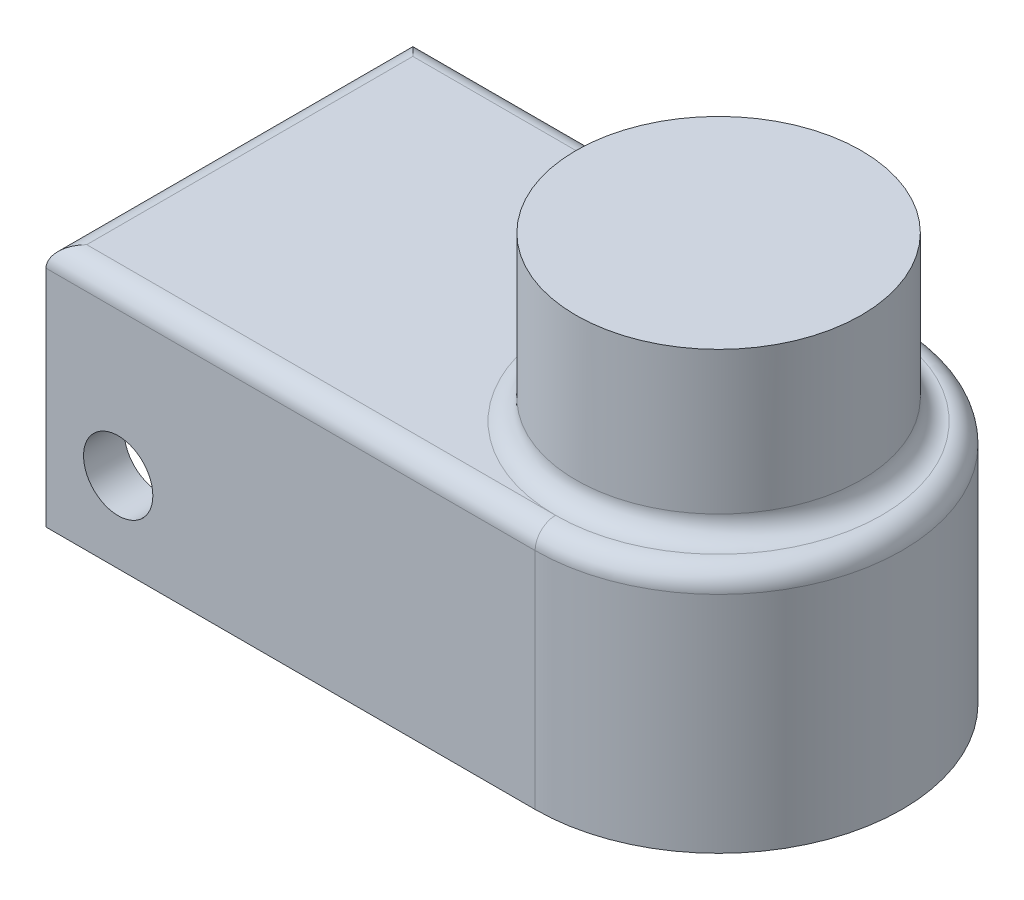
ISO-10303-21;
HEADER;
FILE_DESCRIPTION(('STEP AP214'),'2;1');
FILE_NAME('part.step','',(''),(''),'','','');
FILE_SCHEMA(('AUTOMOTIVE_DESIGN { 1 0 10303 214 1 1 1 1 }'));
ENDSEC;
DATA;
#1=APPLICATION_CONTEXT('core data for automotive mechanical design processes');
#2=APPLICATION_PROTOCOL_DEFINITION('international standard','automotive_design',2000,#1);
#3=PRODUCT_CONTEXT('',#1,'mechanical');
#4=PRODUCT('Part','Part','',(#3));
#5=PRODUCT_RELATED_PRODUCT_CATEGORY('part','',(#4));
#6=PRODUCT_DEFINITION_FORMATION('','',#4);
#7=PRODUCT_DEFINITION_CONTEXT('part definition',#1,'design');
#8=PRODUCT_DEFINITION('design','',#6,#7);
#9=PRODUCT_DEFINITION_SHAPE('','',#8);
#10=(LENGTH_UNIT() NAMED_UNIT(*) SI_UNIT(.MILLI.,.METRE.));
#11=(NAMED_UNIT(*) PLANE_ANGLE_UNIT() SI_UNIT($,.RADIAN.));
#12=(NAMED_UNIT(*) SI_UNIT($,.STERADIAN.) SOLID_ANGLE_UNIT());
#13=UNCERTAINTY_MEASURE_WITH_UNIT(LENGTH_MEASURE(1.E-05),#10,'distance_accuracy_value','');
#14=(GEOMETRIC_REPRESENTATION_CONTEXT(3) GLOBAL_UNCERTAINTY_ASSIGNED_CONTEXT((#13)) GLOBAL_UNIT_ASSIGNED_CONTEXT((#10,
#11,#12)) REPRESENTATION_CONTEXT('',''));
#15=CARTESIAN_POINT('',(0.,0.,0.));
#16=DIRECTION('',(0.,0.,1.));
#17=DIRECTION('',(1.,0.,0.));
#18=AXIS2_PLACEMENT_3D('',#15,#16,#17);
#19=CARTESIAN_POINT('',(152.4,76.2,-57.15));
#20=DIRECTION('',(0.,-1.,0.));
#21=DIRECTION('',(0.,0.,-1.));
#22=AXIS2_PLACEMENT_3D('',#19,#20,#21);
#23=PLANE('',#22);
#24=CARTESIAN_POINT('',(152.4,76.2,-57.15));
#25=DIRECTION('',(0.,-1.,0.));
#26=DIRECTION('',(0.,0.,-1.));
#27=AXIS2_PLACEMENT_3D('',#24,#25,#26);
#28=CIRCLE('',#27,50.8);
#29=CARTESIAN_POINT('',(152.4,76.2,-6.35));
#30=VERTEX_POINT('',#29);
#31=CARTESIAN_POINT('',(152.4,76.2,-107.95));
#32=VERTEX_POINT('',#31);
#33=EDGE_CURVE('E180',#30,#32,#28,.T.);
#34=ORIENTED_EDGE('',*,*,#33,.T.);
#35=DIRECTION('',(-1.,0.,0.));
#36=VECTOR('',#35,1.);
#37=CARTESIAN_POINT('',(152.4,76.2,-107.95));
#38=LINE('',#37,#36);
#39=CARTESIAN_POINT('',(6.34999999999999,76.2,-107.95));
#40=VERTEX_POINT('',#39);
#41=EDGE_CURVE('E182',#32,#40,#38,.T.);
#42=ORIENTED_EDGE('',*,*,#41,.T.);
#43=DIRECTION('',(0.,0.,1.));
#44=VECTOR('',#43,1.);
#45=CARTESIAN_POINT('',(6.34999999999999,76.2,-57.15));
#46=LINE('',#45,#44);
#47=CARTESIAN_POINT('',(6.34999999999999,76.2,-6.35));
#48=VERTEX_POINT('',#47);
#49=EDGE_CURVE('E178',#40,#48,#46,.T.);
#50=ORIENTED_EDGE('',*,*,#49,.T.);
#51=DIRECTION('',(1.,0.,0.));
#52=VECTOR('',#51,1.);
#53=CARTESIAN_POINT('',(152.4,76.2,-6.35));
#54=LINE('',#53,#52);
#55=EDGE_CURVE('E172',#48,#30,#54,.T.);
#56=ORIENTED_EDGE('',*,*,#55,.T.);
#57=EDGE_LOOP('',(#34,#42,#50,#56));
#58=FACE_BOUND('',#57,.T.);
#59=ADVANCED_FACE('F31',(#58),#23,.F.);
#60=CARTESIAN_POINT('',(0.,76.2,0.));
#61=DIRECTION('',(1.,0.,0.));
#62=DIRECTION('',(0.,0.,-1.));
#63=AXIS2_PLACEMENT_3D('',#60,#61,#62);
#64=PLANE('',#63);
#65=DIRECTION('',(0.,-1.,0.));
#66=VECTOR('',#65,1.);
#67=CARTESIAN_POINT('',(0.,76.2,0.));
#68=LINE('',#67,#66);
#69=CARTESIAN_POINT('',(0.,69.85,0.));
#70=VERTEX_POINT('',#69);
#71=CARTESIAN_POINT('',(0.,0.,0.));
#72=VERTEX_POINT('',#71);
#73=EDGE_CURVE('E170',#70,#72,#68,.T.);
#74=ORIENTED_EDGE('',*,*,#73,.F.);
#75=DIRECTION('',(0.,0.,1.));
#76=VECTOR('',#75,1.);
#77=CARTESIAN_POINT('',(0.,69.85,0.));
#78=LINE('',#77,#76);
#79=CARTESIAN_POINT('',(0.,69.85,-114.3));
#80=VERTEX_POINT('',#79);
#81=EDGE_CURVE('E40',#70,#80,#78,.F.);
#82=ORIENTED_EDGE('',*,*,#81,.T.);
#83=DIRECTION('',(0.,-1.,0.));
#84=VECTOR('',#83,1.);
#85=CARTESIAN_POINT('',(0.,76.2,-114.3));
#86=LINE('',#85,#84);
#87=CARTESIAN_POINT('',(0.,0.,-114.3));
#88=VERTEX_POINT('',#87);
#89=EDGE_CURVE('E164',#80,#88,#86,.T.);
#90=ORIENTED_EDGE('',*,*,#89,.T.);
#91=DIRECTION('',(0.,0.,1.));
#92=VECTOR('',#91,1.);
#93=CARTESIAN_POINT('',(0.,0.,0.));
#94=LINE('',#93,#92);
#95=CARTESIAN_POINT('',(0.,0.,-101.6));
#96=VERTEX_POINT('',#95);
#97=EDGE_CURVE('E153',#88,#96,#94,.T.);
#98=ORIENTED_EDGE('',*,*,#97,.T.);
#99=DIRECTION('',(0.,-1.,0.));
#100=VECTOR('',#99,1.);
#101=CARTESIAN_POINT('',(0.,37.592,-101.6));
#102=LINE('',#101,#100);
#103=CARTESIAN_POINT('',(0.,37.592,-101.6));
#104=VERTEX_POINT('',#103);
#105=EDGE_CURVE('E120',#104,#96,#102,.T.);
#106=ORIENTED_EDGE('',*,*,#105,.F.);
#107=DIRECTION('',(0.,0.,-1.));
#108=VECTOR('',#107,1.);
#109=CARTESIAN_POINT('',(0.,37.592,-12.7));
#110=LINE('',#109,#108);
#111=CARTESIAN_POINT('',(0.,37.592,-12.7));
#112=VERTEX_POINT('',#111);
#113=EDGE_CURVE('E127',#112,#104,#110,.T.);
#114=ORIENTED_EDGE('',*,*,#113,.F.);
#115=DIRECTION('',(0.,-1.,0.));
#116=VECTOR('',#115,1.);
#117=CARTESIAN_POINT('',(0.,37.592,-12.7));
#118=LINE('',#117,#116);
#119=CARTESIAN_POINT('',(0.,0.,-12.7));
#120=VERTEX_POINT('',#119);
#121=EDGE_CURVE('E109',#112,#120,#118,.T.);
#122=ORIENTED_EDGE('',*,*,#121,.T.);
#123=EDGE_CURVE('E149',#120,#72,#94,.T.);
#124=ORIENTED_EDGE('',*,*,#123,.T.);
#125=EDGE_LOOP('',(#74,#82,#90,#98,#106,#114,#122,#124));
#126=FACE_BOUND('',#125,.T.);
#127=ADVANCED_FACE('F132',(#126),#64,.F.);
#128=CARTESIAN_POINT('',(0.,76.2,0.));
#129=DIRECTION('',(0.,0.,-1.));
#130=DIRECTION('',(-1.,0.,0.));
#131=AXIS2_PLACEMENT_3D('',#128,#129,#130);
#132=PLANE('',#131);
#133=CARTESIAN_POINT('',(22.4900013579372,25.1025379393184,0.));
#134=DIRECTION('',(0.,0.,1.));
#135=DIRECTION('',(1.,0.,0.));
#136=AXIS2_PLACEMENT_3D('',#133,#134,#135);
#137=CIRCLE('',#136,10.7961289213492);
#138=CARTESIAN_POINT('',(33.2861302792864,25.1025379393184,0.));
#139=VERTEX_POINT('',#138);
#140=EDGE_CURVE('E208',#139,#139,#137,.T.);
#141=ORIENTED_EDGE('',*,*,#140,.F.);
#142=EDGE_LOOP('',(#141));
#143=FACE_BOUND('',#142,.T.);
#144=DIRECTION('',(0.,-1.,0.));
#145=VECTOR('',#144,1.);
#146=CARTESIAN_POINT('',(152.4,76.2,0.));
#147=LINE('',#146,#145);
#148=CARTESIAN_POINT('',(152.4,69.85,0.));
#149=VERTEX_POINT('',#148);
#150=CARTESIAN_POINT('',(152.4,0.,0.));
#151=VERTEX_POINT('',#150);
#152=EDGE_CURVE('E168',#149,#151,#147,.T.);
#153=ORIENTED_EDGE('',*,*,#152,.F.);
#154=DIRECTION('',(1.,0.,0.));
#155=VECTOR('',#154,1.);
#156=CARTESIAN_POINT('',(0.,69.85,0.));
#157=LINE('',#156,#155);
#158=EDGE_CURVE('E11',#149,#70,#157,.F.);
#159=ORIENTED_EDGE('',*,*,#158,.T.);
#160=ORIENTED_EDGE('',*,*,#73,.T.);
#161=DIRECTION('',(1.,0.,0.));
#162=VECTOR('',#161,1.);
#163=CARTESIAN_POINT('',(0.,0.,0.));
#164=LINE('',#163,#162);
#165=EDGE_CURVE('E155',#72,#151,#164,.T.);
#166=ORIENTED_EDGE('',*,*,#165,.T.);
#167=EDGE_LOOP('',(#153,#159,#160,#166));
#168=FACE_BOUND('',#167,.T.);
#169=ADVANCED_FACE('F241',(#143,#168),#132,.F.);
#170=CARTESIAN_POINT('',(152.4,76.2,-57.15));
#171=DIRECTION('',(0.,-1.,0.));
#172=DIRECTION('',(0.,0.,-1.));
#173=AXIS2_PLACEMENT_3D('',#170,#171,#172);
#174=CYLINDRICAL_SURFACE('',#173,57.15);
#175=DIRECTION('',(0.,-1.,0.));
#176=VECTOR('',#175,1.);
#177=CARTESIAN_POINT('',(152.4,76.2,-114.3));
#178=LINE('',#177,#176);
#179=CARTESIAN_POINT('',(152.4,69.85,-114.3));
#180=VERTEX_POINT('',#179);
#181=CARTESIAN_POINT('',(152.4,0.,-114.3));
#182=VERTEX_POINT('',#181);
#183=EDGE_CURVE('E166',#180,#182,#178,.T.);
#184=ORIENTED_EDGE('',*,*,#183,.F.);
#185=CARTESIAN_POINT('',(152.4,69.85,-57.15));
#186=DIRECTION('',(0.,-1.,0.));
#187=DIRECTION('',(0.,0.,-1.));
#188=AXIS2_PLACEMENT_3D('',#185,#186,#187);
#189=CIRCLE('',#188,57.15);
#190=EDGE_CURVE('E54',#180,#149,#189,.T.);
#191=ORIENTED_EDGE('',*,*,#190,.T.);
#192=ORIENTED_EDGE('',*,*,#152,.T.);
#193=CARTESIAN_POINT('',(152.4,0.,-57.15));
#194=DIRECTION('',(0.,1.,0.));
#195=DIRECTION('',(0.,0.,-1.));
#196=AXIS2_PLACEMENT_3D('',#193,#194,#195);
#197=CIRCLE('',#196,57.15);
#198=EDGE_CURVE('E158',#151,#182,#197,.T.);
#199=ORIENTED_EDGE('',*,*,#198,.T.);
#200=EDGE_LOOP('',(#184,#191,#192,#199));
#201=FACE_BOUND('',#200,.T.);
#202=ADVANCED_FACE('F253',(#201),#174,.T.);
#203=CARTESIAN_POINT('',(0.,76.2,-114.3));
#204=DIRECTION('',(0.,0.,1.));
#205=DIRECTION('',(1.,0.,0.));
#206=AXIS2_PLACEMENT_3D('',#203,#204,#205);
#207=PLANE('',#206);
#208=CARTESIAN_POINT('',(22.4900013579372,25.1025379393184,-114.3));
#209=DIRECTION('',(0.,0.,1.));
#210=DIRECTION('',(1.,0.,0.));
#211=AXIS2_PLACEMENT_3D('',#208,#209,#210);
#212=CIRCLE('',#211,10.7961289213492);
#213=CARTESIAN_POINT('',(33.2861302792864,25.1025379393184,-114.3));
#214=VERTEX_POINT('',#213);
#215=EDGE_CURVE('E176',#214,#214,#212,.T.);
#216=ORIENTED_EDGE('',*,*,#215,.T.);
#217=EDGE_LOOP('',(#216));
#218=FACE_BOUND('',#217,.T.);
#219=ORIENTED_EDGE('',*,*,#89,.F.);
#220=DIRECTION('',(-1.,0.,0.));
#221=VECTOR('',#220,1.);
#222=CARTESIAN_POINT('',(0.,69.85,-114.3));
#223=LINE('',#222,#221);
#224=EDGE_CURVE('E185',#80,#180,#223,.F.);
#225=ORIENTED_EDGE('',*,*,#224,.T.);
#226=ORIENTED_EDGE('',*,*,#183,.T.);
#227=DIRECTION('',(-1.,0.,0.));
#228=VECTOR('',#227,1.);
#229=CARTESIAN_POINT('',(0.,0.,-114.3));
#230=LINE('',#229,#228);
#231=EDGE_CURVE('E161',#182,#88,#230,.T.);
#232=ORIENTED_EDGE('',*,*,#231,.T.);
#233=EDGE_LOOP('',(#219,#225,#226,#232));
#234=FACE_BOUND('',#233,.T.);
#235=ADVANCED_FACE('F249',(#218,#234),#207,.F.);
#236=CARTESIAN_POINT('',(152.4,0.,-57.15));
#237=DIRECTION('',(0.,-1.,0.));
#238=DIRECTION('',(0.,0.,-1.));
#239=AXIS2_PLACEMENT_3D('',#236,#237,#238);
#240=PLANE('',#239);
#241=DIRECTION('',(-1.,0.,0.));
#242=VECTOR('',#241,1.);
#243=CARTESIAN_POINT('',(152.4,0.,-12.7));
#244=LINE('',#243,#242);
#245=CARTESIAN_POINT('',(152.4,0.,-12.7));
#246=VERTEX_POINT('',#245);
#247=EDGE_CURVE('E115',#246,#120,#244,.T.);
#248=ORIENTED_EDGE('',*,*,#247,.F.);
#249=CARTESIAN_POINT('',(152.4,0.,-57.15));
#250=DIRECTION('',(0.,-1.,0.));
#251=DIRECTION('',(0.,0.,-1.));
#252=AXIS2_PLACEMENT_3D('',#249,#250,#251);
#253=CIRCLE('',#252,44.45);
#254=CARTESIAN_POINT('',(152.4,0.,-101.6));
#255=VERTEX_POINT('',#254);
#256=EDGE_CURVE('E130',#255,#246,#253,.T.);
#257=ORIENTED_EDGE('',*,*,#256,.F.);
#258=DIRECTION('',(1.,0.,0.));
#259=VECTOR('',#258,1.);
#260=CARTESIAN_POINT('',(0.,0.,-101.6));
#261=LINE('',#260,#259);
#262=EDGE_CURVE('E141',#96,#255,#261,.T.);
#263=ORIENTED_EDGE('',*,*,#262,.F.);
#264=ORIENTED_EDGE('',*,*,#97,.F.);
#265=ORIENTED_EDGE('',*,*,#231,.F.);
#266=ORIENTED_EDGE('',*,*,#198,.F.);
#267=ORIENTED_EDGE('',*,*,#165,.F.);
#268=ORIENTED_EDGE('',*,*,#123,.F.);
#269=EDGE_LOOP('',(#248,#257,#263,#264,#265,#266,#267,#268));
#270=FACE_BOUND('',#269,.T.);
#271=ADVANCED_FACE('F246',(#270),#240,.T.);
#272=CARTESIAN_POINT('',(152.4,37.592,-12.7));
#273=DIRECTION('',(0.,0.,1.));
#274=DIRECTION('',(1.,0.,0.));
#275=AXIS2_PLACEMENT_3D('',#272,#273,#274);
#276=PLANE('',#275);
#277=CARTESIAN_POINT('',(22.4900013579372,25.1025379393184,-12.7));
#278=DIRECTION('',(0.,0.,1.));
#279=DIRECTION('',(1.,0.,0.));
#280=AXIS2_PLACEMENT_3D('',#277,#278,#279);
#281=CIRCLE('',#280,10.7961289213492);
#282=CARTESIAN_POINT('',(33.2861302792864,25.1025379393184,-12.7));
#283=VERTEX_POINT('',#282);
#284=EDGE_CURVE('E142',#283,#283,#281,.T.);
#285=ORIENTED_EDGE('',*,*,#284,.T.);
#286=EDGE_LOOP('',(#285));
#287=FACE_BOUND('',#286,.T.);
#288=ORIENTED_EDGE('',*,*,#247,.T.);
#289=ORIENTED_EDGE('',*,*,#121,.F.);
#290=DIRECTION('',(-1.,0.,0.));
#291=VECTOR('',#290,1.);
#292=CARTESIAN_POINT('',(152.4,37.592,-12.7));
#293=LINE('',#292,#291);
#294=CARTESIAN_POINT('',(152.4,37.592,-12.7));
#295=VERTEX_POINT('',#294);
#296=EDGE_CURVE('E112',#295,#112,#293,.T.);
#297=ORIENTED_EDGE('',*,*,#296,.F.);
#298=DIRECTION('',(0.,-1.,0.));
#299=VECTOR('',#298,1.);
#300=CARTESIAN_POINT('',(152.4,37.592,-12.7));
#301=LINE('',#300,#299);
#302=EDGE_CURVE('E147',#295,#246,#301,.T.);
#303=ORIENTED_EDGE('',*,*,#302,.T.);
#304=EDGE_LOOP('',(#288,#289,#297,#303));
#305=FACE_BOUND('',#304,.T.);
#306=ADVANCED_FACE('F111',(#287,#305),#276,.F.);
#307=CARTESIAN_POINT('',(152.4,37.592,-57.15));
#308=DIRECTION('',(0.,-1.,0.));
#309=DIRECTION('',(0.,0.,-1.));
#310=AXIS2_PLACEMENT_3D('',#307,#308,#309);
#311=CYLINDRICAL_SURFACE('',#310,44.45);
#312=ORIENTED_EDGE('',*,*,#256,.T.);
#313=ORIENTED_EDGE('',*,*,#302,.F.);
#314=CARTESIAN_POINT('',(152.4,37.592,-57.15));
#315=DIRECTION('',(0.,-1.,0.));
#316=DIRECTION('',(0.,0.,-1.));
#317=AXIS2_PLACEMENT_3D('',#314,#315,#316);
#318=CIRCLE('',#317,44.45);
#319=CARTESIAN_POINT('',(152.4,37.592,-101.6));
#320=VERTEX_POINT('',#319);
#321=EDGE_CURVE('E121',#320,#295,#318,.T.);
#322=ORIENTED_EDGE('',*,*,#321,.F.);
#323=DIRECTION('',(0.,-1.,0.));
#324=VECTOR('',#323,1.);
#325=CARTESIAN_POINT('',(152.4,37.592,-101.6));
#326=LINE('',#325,#324);
#327=EDGE_CURVE('E150',#320,#255,#326,.T.);
#328=ORIENTED_EDGE('',*,*,#327,.T.);
#329=EDGE_LOOP('',(#312,#313,#322,#328));
#330=FACE_BOUND('',#329,.T.);
#331=ADVANCED_FACE('F296',(#330),#311,.F.);
#332=CARTESIAN_POINT('',(0.,37.592,-101.6));
#333=DIRECTION('',(0.,0.,-1.));
#334=DIRECTION('',(-1.,0.,0.));
#335=AXIS2_PLACEMENT_3D('',#332,#333,#334);
#336=PLANE('',#335);
#337=CARTESIAN_POINT('',(22.4900013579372,25.1025379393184,-101.6));
#338=DIRECTION('',(0.,0.,-1.));
#339=DIRECTION('',(-1.,0.,0.));
#340=AXIS2_PLACEMENT_3D('',#337,#338,#339);
#341=CIRCLE('',#340,10.7961289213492);
#342=CARTESIAN_POINT('',(33.2861302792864,25.1025379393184,-101.6));
#343=VERTEX_POINT('',#342);
#344=EDGE_CURVE('E173',#343,#343,#341,.T.);
#345=ORIENTED_EDGE('',*,*,#344,.T.);
#346=EDGE_LOOP('',(#345));
#347=FACE_BOUND('',#346,.T.);
#348=ORIENTED_EDGE('',*,*,#262,.T.);
#349=ORIENTED_EDGE('',*,*,#327,.F.);
#350=DIRECTION('',(1.,0.,0.));
#351=VECTOR('',#350,1.);
#352=CARTESIAN_POINT('',(0.,37.592,-101.6));
#353=LINE('',#352,#351);
#354=EDGE_CURVE('E134',#104,#320,#353,.T.);
#355=ORIENTED_EDGE('',*,*,#354,.F.);
#356=ORIENTED_EDGE('',*,*,#105,.T.);
#357=EDGE_LOOP('',(#348,#349,#355,#356));
#358=FACE_BOUND('',#357,.T.);
#359=ADVANCED_FACE('F294',(#347,#358),#336,.F.);
#360=CARTESIAN_POINT('',(152.4,37.592,-57.15));
#361=DIRECTION('',(0.,-1.,0.));
#362=DIRECTION('',(0.,0.,-1.));
#363=AXIS2_PLACEMENT_3D('',#360,#361,#362);
#364=PLANE('',#363);
#365=ORIENTED_EDGE('',*,*,#296,.T.);
#366=ORIENTED_EDGE('',*,*,#113,.T.);
#367=ORIENTED_EDGE('',*,*,#354,.T.);
#368=ORIENTED_EDGE('',*,*,#321,.T.);
#369=EDGE_LOOP('',(#365,#366,#367,#368));
#370=FACE_BOUND('',#369,.T.);
#371=ADVANCED_FACE('F125',(#370),#364,.T.);
#372=CARTESIAN_POINT('',(22.4900013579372,25.1025379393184,-114.3));
#373=DIRECTION('',(0.,0.,1.));
#374=DIRECTION('',(1.,0.,0.));
#375=AXIS2_PLACEMENT_3D('',#372,#373,#374);
#376=CYLINDRICAL_SURFACE('',#375,10.7961289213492);
#377=CARTESIAN_POINT('',(33.2861302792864,25.1025379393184,-114.3));
#378=CARTESIAN_POINT('',(33.2861302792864,25.1025379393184,-114.167708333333));
#379=CARTESIAN_POINT('',(33.2861302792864,25.1025379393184,-114.035416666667));
#380=CARTESIAN_POINT('',(33.2861302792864,25.1025379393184,-113.770833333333));
#381=CARTESIAN_POINT('',(33.2861302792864,25.1025379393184,-113.638541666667));
#382=CARTESIAN_POINT('',(33.2861302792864,25.1025379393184,-113.373958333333));
#383=CARTESIAN_POINT('',(33.2861302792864,25.1025379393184,-113.241666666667));
#384=CARTESIAN_POINT('',(33.2861302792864,25.1025379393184,-112.977083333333));
#385=CARTESIAN_POINT('',(33.2861302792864,25.1025379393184,-112.844791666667));
#386=CARTESIAN_POINT('',(33.2861302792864,25.1025379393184,-112.580208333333));
#387=CARTESIAN_POINT('',(33.2861302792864,25.1025379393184,-112.447916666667));
#388=CARTESIAN_POINT('',(33.2861302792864,25.1025379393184,-112.183333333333));
#389=CARTESIAN_POINT('',(33.2861302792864,25.1025379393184,-112.051041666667));
#390=CARTESIAN_POINT('',(33.2861302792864,25.1025379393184,-111.786458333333));
#391=CARTESIAN_POINT('',(33.2861302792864,25.1025379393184,-111.654166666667));
#392=CARTESIAN_POINT('',(33.2861302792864,25.1025379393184,-111.389583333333));
#393=CARTESIAN_POINT('',(33.2861302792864,25.1025379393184,-111.257291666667));
#394=CARTESIAN_POINT('',(33.2861302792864,25.1025379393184,-110.992708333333));
#395=CARTESIAN_POINT('',(33.2861302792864,25.1025379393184,-110.860416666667));
#396=CARTESIAN_POINT('',(33.2861302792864,25.1025379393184,-110.595833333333));
#397=CARTESIAN_POINT('',(33.2861302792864,25.1025379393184,-110.463541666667));
#398=CARTESIAN_POINT('',(33.2861302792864,25.1025379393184,-110.198958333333));
#399=CARTESIAN_POINT('',(33.2861302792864,25.1025379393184,-110.066666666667));
#400=CARTESIAN_POINT('',(33.2861302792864,25.1025379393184,-109.802083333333));
#401=CARTESIAN_POINT('',(33.2861302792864,25.1025379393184,-109.669791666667));
#402=CARTESIAN_POINT('',(33.2861302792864,25.1025379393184,-109.405208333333));
#403=CARTESIAN_POINT('',(33.2861302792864,25.1025379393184,-109.272916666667));
#404=CARTESIAN_POINT('',(33.2861302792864,25.1025379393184,-109.008333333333));
#405=CARTESIAN_POINT('',(33.2861302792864,25.1025379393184,-108.876041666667));
#406=CARTESIAN_POINT('',(33.2861302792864,25.1025379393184,-108.611458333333));
#407=CARTESIAN_POINT('',(33.2861302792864,25.1025379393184,-108.479166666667));
#408=CARTESIAN_POINT('',(33.2861302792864,25.1025379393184,-108.214583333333));
#409=CARTESIAN_POINT('',(33.2861302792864,25.1025379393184,-108.082291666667));
#410=CARTESIAN_POINT('',(33.2861302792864,25.1025379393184,-107.817708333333));
#411=CARTESIAN_POINT('',(33.2861302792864,25.1025379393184,-107.685416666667));
#412=CARTESIAN_POINT('',(33.2861302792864,25.1025379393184,-107.420833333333));
#413=CARTESIAN_POINT('',(33.2861302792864,25.1025379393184,-107.288541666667));
#414=CARTESIAN_POINT('',(33.2861302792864,25.1025379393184,-107.023958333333));
#415=CARTESIAN_POINT('',(33.2861302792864,25.1025379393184,-106.891666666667));
#416=CARTESIAN_POINT('',(33.2861302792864,25.1025379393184,-106.627083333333));
#417=CARTESIAN_POINT('',(33.2861302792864,25.1025379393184,-106.494791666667));
#418=CARTESIAN_POINT('',(33.2861302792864,25.1025379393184,-106.230208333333));
#419=CARTESIAN_POINT('',(33.2861302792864,25.1025379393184,-106.097916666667));
#420=CARTESIAN_POINT('',(33.2861302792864,25.1025379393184,-105.833333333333));
#421=CARTESIAN_POINT('',(33.2861302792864,25.1025379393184,-105.701041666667));
#422=CARTESIAN_POINT('',(33.2861302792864,25.1025379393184,-105.436458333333));
#423=CARTESIAN_POINT('',(33.2861302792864,25.1025379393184,-105.304166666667));
#424=CARTESIAN_POINT('',(33.2861302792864,25.1025379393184,-105.039583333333));
#425=CARTESIAN_POINT('',(33.2861302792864,25.1025379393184,-104.907291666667));
#426=CARTESIAN_POINT('',(33.2861302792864,25.1025379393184,-104.642708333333));
#427=CARTESIAN_POINT('',(33.2861302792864,25.1025379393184,-104.510416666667));
#428=CARTESIAN_POINT('',(33.2861302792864,25.1025379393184,-104.245833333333));
#429=CARTESIAN_POINT('',(33.2861302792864,25.1025379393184,-104.113541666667));
#430=CARTESIAN_POINT('',(33.2861302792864,25.1025379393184,-103.848958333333));
#431=CARTESIAN_POINT('',(33.2861302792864,25.1025379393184,-103.716666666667));
#432=CARTESIAN_POINT('',(33.2861302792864,25.1025379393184,-103.452083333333));
#433=CARTESIAN_POINT('',(33.2861302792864,25.1025379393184,-103.319791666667));
#434=CARTESIAN_POINT('',(33.2861302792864,25.1025379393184,-103.055208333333));
#435=CARTESIAN_POINT('',(33.2861302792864,25.1025379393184,-102.922916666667));
#436=CARTESIAN_POINT('',(33.2861302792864,25.1025379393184,-102.658333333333));
#437=CARTESIAN_POINT('',(33.2861302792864,25.1025379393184,-102.526041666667));
#438=CARTESIAN_POINT('',(33.2861302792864,25.1025379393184,-102.261458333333));
#439=CARTESIAN_POINT('',(33.2861302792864,25.1025379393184,-102.129166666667));
#440=CARTESIAN_POINT('',(33.2861302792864,25.1025379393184,-101.864583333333));
#441=CARTESIAN_POINT('',(33.2861302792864,25.1025379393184,-101.732291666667));
#442=CARTESIAN_POINT('',(33.2861302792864,25.1025379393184,-101.6));
#443=B_SPLINE_CURVE_WITH_KNOTS('',3,(#377,#378,#379,#380,#381,#382,#383,#384,#385,#386,#387,
#388,#389,#390,#391,#392,#393,#394,#395,#396,#397,#398,#399,#400,#401,#402,#403,#404,#405,#406,
#407,#408,#409,#410,#411,#412,#413,#414,#415,#416,#417,#418,#419,#420,#421,#422,#423,#424,#425,
#426,#427,#428,#429,#430,#431,#432,#433,#434,#435,#436,#437,#438,#439,#440,#441,#442),
.UNSPECIFIED.,.F.,.F.,(4,2,2,2,2,2,2,2,2,2,2,2,2,2,2,2,2,2,2,2,2,2,2,2,2,2,2,2,2,2,2,2,4),(0.,
0.396875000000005,0.79375000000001,1.19062500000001,1.58750000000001,1.98437500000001,
2.38125000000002,2.77812500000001,3.17500000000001,3.57187500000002,3.96875000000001,
4.36562500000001,4.76250000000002,5.15937500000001,5.55625000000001,5.95312500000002,
6.35000000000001,6.74687500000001,7.14375000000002,7.54062500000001,7.93750000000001,
8.33437500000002,8.73125000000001,9.12812500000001,9.52500000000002,9.92187500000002,10.31875,
10.715625,11.1125,11.509375,11.90625,12.303125,12.7),.UNSPECIFIED.);
#444=EDGE_CURVE('BSEAM223',#214,#343,#443,.T.);
#445=ORIENTED_EDGE('',*,*,#215,.F.);
#446=ORIENTED_EDGE('',*,*,#344,.F.);
#447=ORIENTED_EDGE('',*,*,#444,.T.);
#448=ORIENTED_EDGE('',*,*,#444,.F.);
#449=EDGE_LOOP('',(#445,#447,#446,#448));
#450=FACE_BOUND('',#449,.T.);
#451=ADVANCED_FACE('F223',(#450),#376,.F.);
#452=CARTESIAN_POINT('',(33.2861302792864,25.1025379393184,0.));
#453=CARTESIAN_POINT('',(33.2861302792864,25.1025379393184,-0.132291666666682));
#454=CARTESIAN_POINT('',(33.2861302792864,25.1025379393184,-0.26458333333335));
#455=CARTESIAN_POINT('',(33.2861302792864,25.1025379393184,-0.529166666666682));
#456=CARTESIAN_POINT('',(33.2861302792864,25.1025379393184,-0.661458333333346));
#457=CARTESIAN_POINT('',(33.2861302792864,25.1025379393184,-0.926041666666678));
#458=CARTESIAN_POINT('',(33.2861302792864,25.1025379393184,-1.05833333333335));
#459=CARTESIAN_POINT('',(33.2861302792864,25.1025379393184,-1.32291666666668));
#460=CARTESIAN_POINT('',(33.2861302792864,25.1025379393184,-1.45520833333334));
#461=CARTESIAN_POINT('',(33.2861302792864,25.1025379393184,-1.71979166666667));
#462=CARTESIAN_POINT('',(33.2861302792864,25.1025379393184,-1.85208333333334));
#463=CARTESIAN_POINT('',(33.2861302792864,25.1025379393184,-2.11666666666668));
#464=CARTESIAN_POINT('',(33.2861302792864,25.1025379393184,-2.24895833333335));
#465=CARTESIAN_POINT('',(33.2861302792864,25.1025379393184,-2.51354166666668));
#466=CARTESIAN_POINT('',(33.2861302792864,25.1025379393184,-2.64583333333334));
#467=CARTESIAN_POINT('',(33.2861302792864,25.1025379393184,-2.91041666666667));
#468=CARTESIAN_POINT('',(33.2861302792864,25.1025379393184,-3.04270833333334));
#469=CARTESIAN_POINT('',(33.2861302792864,25.1025379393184,-3.30729166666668));
#470=CARTESIAN_POINT('',(33.2861302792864,25.1025379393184,-3.43958333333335));
#471=CARTESIAN_POINT('',(33.2861302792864,25.1025379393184,-3.70416666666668));
#472=CARTESIAN_POINT('',(33.2861302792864,25.1025379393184,-3.83645833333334));
#473=CARTESIAN_POINT('',(33.2861302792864,25.1025379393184,-4.10104166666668));
#474=CARTESIAN_POINT('',(33.2861302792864,25.1025379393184,-4.23333333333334));
#475=CARTESIAN_POINT('',(33.2861302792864,25.1025379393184,-4.49791666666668));
#476=CARTESIAN_POINT('',(33.2861302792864,25.1025379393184,-4.63020833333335));
#477=CARTESIAN_POINT('',(33.2861302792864,25.1025379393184,-4.89479166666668));
#478=CARTESIAN_POINT('',(33.2861302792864,25.1025379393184,-5.02708333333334));
#479=CARTESIAN_POINT('',(33.2861302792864,25.1025379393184,-5.29166666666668));
#480=CARTESIAN_POINT('',(33.2861302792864,25.1025379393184,-5.42395833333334));
#481=CARTESIAN_POINT('',(33.2861302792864,25.1025379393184,-5.68854166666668));
#482=CARTESIAN_POINT('',(33.2861302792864,25.1025379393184,-5.82083333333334));
#483=CARTESIAN_POINT('',(33.2861302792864,25.1025379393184,-6.08541666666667));
#484=CARTESIAN_POINT('',(33.2861302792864,25.1025379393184,-6.21770833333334));
#485=CARTESIAN_POINT('',(33.2861302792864,25.1025379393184,-6.48229166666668));
#486=CARTESIAN_POINT('',(33.2861302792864,25.1025379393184,-6.61458333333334));
#487=CARTESIAN_POINT('',(33.2861302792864,25.1025379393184,-6.87916666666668));
#488=CARTESIAN_POINT('',(33.2861302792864,25.1025379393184,-7.01145833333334));
#489=CARTESIAN_POINT('',(33.2861302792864,25.1025379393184,-7.27604166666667));
#490=CARTESIAN_POINT('',(33.2861302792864,25.1025379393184,-7.40833333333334));
#491=CARTESIAN_POINT('',(33.2861302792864,25.1025379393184,-7.67291666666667));
#492=CARTESIAN_POINT('',(33.2861302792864,25.1025379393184,-7.80520833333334));
#493=CARTESIAN_POINT('',(33.2861302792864,25.1025379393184,-8.06979166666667));
#494=CARTESIAN_POINT('',(33.2861302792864,25.1025379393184,-8.20208333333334));
#495=CARTESIAN_POINT('',(33.2861302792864,25.1025379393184,-8.46666666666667));
#496=CARTESIAN_POINT('',(33.2861302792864,25.1025379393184,-8.59895833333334));
#497=CARTESIAN_POINT('',(33.2861302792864,25.1025379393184,-8.86354166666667));
#498=CARTESIAN_POINT('',(33.2861302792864,25.1025379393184,-8.99583333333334));
#499=CARTESIAN_POINT('',(33.2861302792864,25.1025379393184,-9.26041666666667));
#500=CARTESIAN_POINT('',(33.2861302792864,25.1025379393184,-9.39270833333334));
#501=CARTESIAN_POINT('',(33.2861302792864,25.1025379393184,-9.65729166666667));
#502=CARTESIAN_POINT('',(33.2861302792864,25.1025379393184,-9.78958333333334));
#503=CARTESIAN_POINT('',(33.2861302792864,25.1025379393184,-10.0541666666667));
#504=CARTESIAN_POINT('',(33.2861302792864,25.1025379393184,-10.1864583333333));
#505=CARTESIAN_POINT('',(33.2861302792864,25.1025379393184,-10.4510416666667));
#506=CARTESIAN_POINT('',(33.2861302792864,25.1025379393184,-10.5833333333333));
#507=CARTESIAN_POINT('',(33.2861302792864,25.1025379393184,-10.8479166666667));
#508=CARTESIAN_POINT('',(33.2861302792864,25.1025379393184,-10.9802083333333));
#509=CARTESIAN_POINT('',(33.2861302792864,25.1025379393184,-11.2447916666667));
#510=CARTESIAN_POINT('',(33.2861302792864,25.1025379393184,-11.3770833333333));
#511=CARTESIAN_POINT('',(33.2861302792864,25.1025379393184,-11.6416666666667));
#512=CARTESIAN_POINT('',(33.2861302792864,25.1025379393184,-11.7739583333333));
#513=CARTESIAN_POINT('',(33.2861302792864,25.1025379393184,-12.0385416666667));
#514=CARTESIAN_POINT('',(33.2861302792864,25.1025379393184,-12.1708333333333));
#515=CARTESIAN_POINT('',(33.2861302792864,25.1025379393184,-12.4354166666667));
#516=CARTESIAN_POINT('',(33.2861302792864,25.1025379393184,-12.5677083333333));
#517=CARTESIAN_POINT('',(33.2861302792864,25.1025379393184,-12.7));
#518=B_SPLINE_CURVE_WITH_KNOTS('',3,(#452,#453,#454,#455,#456,#457,#458,#459,#460,#461,#462,
#463,#464,#465,#466,#467,#468,#469,#470,#471,#472,#473,#474,#475,#476,#477,#478,#479,#480,#481,
#482,#483,#484,#485,#486,#487,#488,#489,#490,#491,#492,#493,#494,#495,#496,#497,#498,#499,#500,
#501,#502,#503,#504,#505,#506,#507,#508,#509,#510,#511,#512,#513,#514,#515,#516,#517),
.UNSPECIFIED.,.F.,.F.,(4,2,2,2,2,2,2,2,2,2,2,2,2,2,2,2,2,2,2,2,2,2,2,2,2,2,2,2,2,2,2,2,4),(0.,
0.396875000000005,0.793749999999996,1.190625,1.58749999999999,1.984375,2.38125,2.77812499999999,
3.175,3.571875,3.96874999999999,4.365625,4.7625,5.15937499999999,5.55625,5.95312499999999,
6.34999999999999,6.746875,7.14374999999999,7.540625,7.93749999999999,8.33437499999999,8.73125,
9.12812499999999,9.52499999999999,9.921875,10.31875,10.715625,11.1125,11.509375,11.90625,
12.303125,12.7),.UNSPECIFIED.);
#519=EDGE_CURVE('BSEAM220',#139,#283,#518,.T.);
#520=ORIENTED_EDGE('',*,*,#140,.T.);
#521=ORIENTED_EDGE('',*,*,#284,.F.);
#522=ORIENTED_EDGE('',*,*,#519,.T.);
#523=ORIENTED_EDGE('',*,*,#519,.F.);
#524=EDGE_LOOP('',(#520,#522,#521,#523));
#525=FACE_BOUND('',#524,.T.);
#526=ADVANCED_FACE('F220',(#525),#376,.F.);
#527=CARTESIAN_POINT('',(152.4,127.,-57.15));
#528=DIRECTION('',(0.,-1.,0.));
#529=DIRECTION('',(0.,0.,-1.));
#530=AXIS2_PLACEMENT_3D('',#527,#528,#529);
#531=CYLINDRICAL_SURFACE('',#530,44.45);
#532=CARTESIAN_POINT('',(152.4,82.55,-57.15));
#533=DIRECTION('',(0.,-1.,0.));
#534=DIRECTION('',(0.,0.,-1.));
#535=AXIS2_PLACEMENT_3D('',#532,#533,#534);
#536=CIRCLE('',#535,44.45);
#537=CARTESIAN_POINT('',(152.4,82.55,-101.6));
#538=VERTEX_POINT('',#537);
#539=EDGE_CURVE('E189',#538,#538,#536,.F.);
#540=ORIENTED_EDGE('',*,*,#539,.T.);
#541=EDGE_LOOP('',(#540));
#542=FACE_BOUND('',#541,.T.);
#543=CARTESIAN_POINT('',(152.4,127.,-57.15));
#544=DIRECTION('',(0.,1.,0.));
#545=DIRECTION('',(0.,0.,1.));
#546=AXIS2_PLACEMENT_3D('',#543,#544,#545);
#547=CIRCLE('',#546,44.45);
#548=CARTESIAN_POINT('',(152.4,127.,-12.7));
#549=VERTEX_POINT('',#548);
#550=EDGE_CURVE('E205',#549,#549,#547,.T.);
#551=ORIENTED_EDGE('',*,*,#550,.F.);
#552=EDGE_LOOP('',(#551));
#553=FACE_BOUND('',#552,.T.);
#554=ADVANCED_FACE('F222',(#542,#553),#531,.T.);
#555=CARTESIAN_POINT('',(152.4,127.,-57.15));
#556=DIRECTION('',(0.,1.,0.));
#557=DIRECTION('',(0.,0.,1.));
#558=AXIS2_PLACEMENT_3D('',#555,#556,#557);
#559=PLANE('',#558);
#560=ORIENTED_EDGE('',*,*,#550,.T.);
#561=EDGE_LOOP('',(#560));
#562=FACE_BOUND('',#561,.T.);
#563=ADVANCED_FACE('F230',(#562),#559,.T.);
#564=CARTESIAN_POINT('',(152.4,82.55,-57.15));
#565=DIRECTION('',(0.,-1.,0.));
#566=DIRECTION('',(0.,0.,-1.));
#567=AXIS2_PLACEMENT_3D('',#564,#565,#566);
#568=TOROIDAL_SURFACE('',#567,50.8,6.35);
#569=ORIENTED_EDGE('',*,*,#539,.F.);
#570=EDGE_LOOP('',(#569));
#571=FACE_BOUND('',#570,.T.);
#572=CARTESIAN_POINT('',(152.4,76.2,-57.15));
#573=DIRECTION('',(0.,-1.,0.));
#574=DIRECTION('',(0.,0.,-1.));
#575=AXIS2_PLACEMENT_3D('',#572,#573,#574);
#576=CIRCLE('',#575,50.8);
#577=EDGE_CURVE('E199',#32,#30,#576,.T.);
#578=ORIENTED_EDGE('',*,*,#577,.F.);
#579=ORIENTED_EDGE('',*,*,#33,.F.);
#580=EDGE_LOOP('',(#578,#579));
#581=FACE_BOUND('',#580,.T.);
#582=ADVANCED_FACE('F33',(#571,#581),#568,.F.);
#583=CARTESIAN_POINT('',(152.4,69.85,-6.35));
#584=DIRECTION('',(1.,0.,0.));
#585=DIRECTION('',(0.,0.,-1.));
#586=AXIS2_PLACEMENT_3D('',#583,#584,#585);
#587=CYLINDRICAL_SURFACE('',#586,6.35);
#588=CARTESIAN_POINT('',(6.34999999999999,69.85,-6.35));
#589=DIRECTION('',(0.707106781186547,0.,0.707106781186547));
#590=DIRECTION('',(0.707106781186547,0.,-0.707106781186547));
#591=AXIS2_PLACEMENT_3D('',#588,#589,#590);
#592=ELLIPSE('',#591,8.98025612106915,6.35);
#593=EDGE_CURVE('E197',#70,#48,#592,.F.);
#594=ORIENTED_EDGE('',*,*,#593,.F.);
#595=ORIENTED_EDGE('',*,*,#158,.F.);
#596=CARTESIAN_POINT('',(152.4,69.85,-6.35));
#597=DIRECTION('',(1.,0.,0.));
#598=DIRECTION('',(0.,0.,-1.));
#599=AXIS2_PLACEMENT_3D('',#596,#597,#598);
#600=CIRCLE('',#599,6.35);
#601=EDGE_CURVE('E35',#30,#149,#600,.T.);
#602=ORIENTED_EDGE('',*,*,#601,.F.);
#603=ORIENTED_EDGE('',*,*,#55,.F.);
#604=EDGE_LOOP('',(#594,#595,#602,#603));
#605=FACE_BOUND('',#604,.T.);
#606=ADVANCED_FACE('F270',(#605),#587,.T.);
#607=CARTESIAN_POINT('',(152.4,69.85,-57.15));
#608=DIRECTION('',(0.,-1.,0.));
#609=DIRECTION('',(0.,0.,-1.));
#610=AXIS2_PLACEMENT_3D('',#607,#608,#609);
#611=TOROIDAL_SURFACE('',#610,50.8,6.35);
#612=ORIENTED_EDGE('',*,*,#601,.T.);
#613=ORIENTED_EDGE('',*,*,#190,.F.);
#614=CARTESIAN_POINT('',(152.4,69.85,-107.95));
#615=DIRECTION('',(-1.,0.,0.));
#616=DIRECTION('',(0.,0.,1.));
#617=AXIS2_PLACEMENT_3D('',#614,#615,#616);
#618=CIRCLE('',#617,6.35);
#619=EDGE_CURVE('E195',#32,#180,#618,.T.);
#620=ORIENTED_EDGE('',*,*,#619,.F.);
#621=ORIENTED_EDGE('',*,*,#577,.T.);
#622=EDGE_LOOP('',(#612,#613,#620,#621));
#623=FACE_BOUND('',#622,.T.);
#624=ADVANCED_FACE('F267',(#623),#611,.T.);
#625=CARTESIAN_POINT('',(6.34999999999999,69.85,-57.15));
#626=DIRECTION('',(0.,0.,1.));
#627=DIRECTION('',(1.,0.,0.));
#628=AXIS2_PLACEMENT_3D('',#625,#626,#627);
#629=CYLINDRICAL_SURFACE('',#628,6.35);
#630=ORIENTED_EDGE('',*,*,#593,.T.);
#631=ORIENTED_EDGE('',*,*,#49,.F.);
#632=CARTESIAN_POINT('',(6.34999999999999,69.85,-107.95));
#633=DIRECTION('',(-0.707106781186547,0.,0.707106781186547));
#634=DIRECTION('',(0.707106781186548,0.,0.707106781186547));
#635=AXIS2_PLACEMENT_3D('',#632,#633,#634);
#636=ELLIPSE('',#635,8.98025612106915,6.35);
#637=EDGE_CURVE('E193',#80,#40,#636,.F.);
#638=ORIENTED_EDGE('',*,*,#637,.F.);
#639=ORIENTED_EDGE('',*,*,#81,.F.);
#640=EDGE_LOOP('',(#630,#631,#638,#639));
#641=FACE_BOUND('',#640,.T.);
#642=ADVANCED_FACE('F263',(#641),#629,.T.);
#643=CARTESIAN_POINT('',(152.4,69.85,-107.95));
#644=DIRECTION('',(-1.,0.,0.));
#645=DIRECTION('',(0.,0.,1.));
#646=AXIS2_PLACEMENT_3D('',#643,#644,#645);
#647=CYLINDRICAL_SURFACE('',#646,6.35);
#648=ORIENTED_EDGE('',*,*,#619,.T.);
#649=ORIENTED_EDGE('',*,*,#224,.F.);
#650=ORIENTED_EDGE('',*,*,#637,.T.);
#651=ORIENTED_EDGE('',*,*,#41,.F.);
#652=EDGE_LOOP('',(#648,#649,#650,#651));
#653=FACE_BOUND('',#652,.T.);
#654=ADVANCED_FACE('F260',(#653),#647,.T.);
#655=CLOSED_SHELL('',(#59,#127,#169,#202,#235,#271,#306,#331,#359,#371,#451,#526,#554,#563,#582,
#606,#624,#642,#654));
#656=MANIFOLD_SOLID_BREP('B2',#655);
#657=ADVANCED_BREP_SHAPE_REPRESENTATION('',(#18,#656),#14);
#658=SHAPE_DEFINITION_REPRESENTATION(#9,#657);
ENDSEC;
END-ISO-10303-21;
